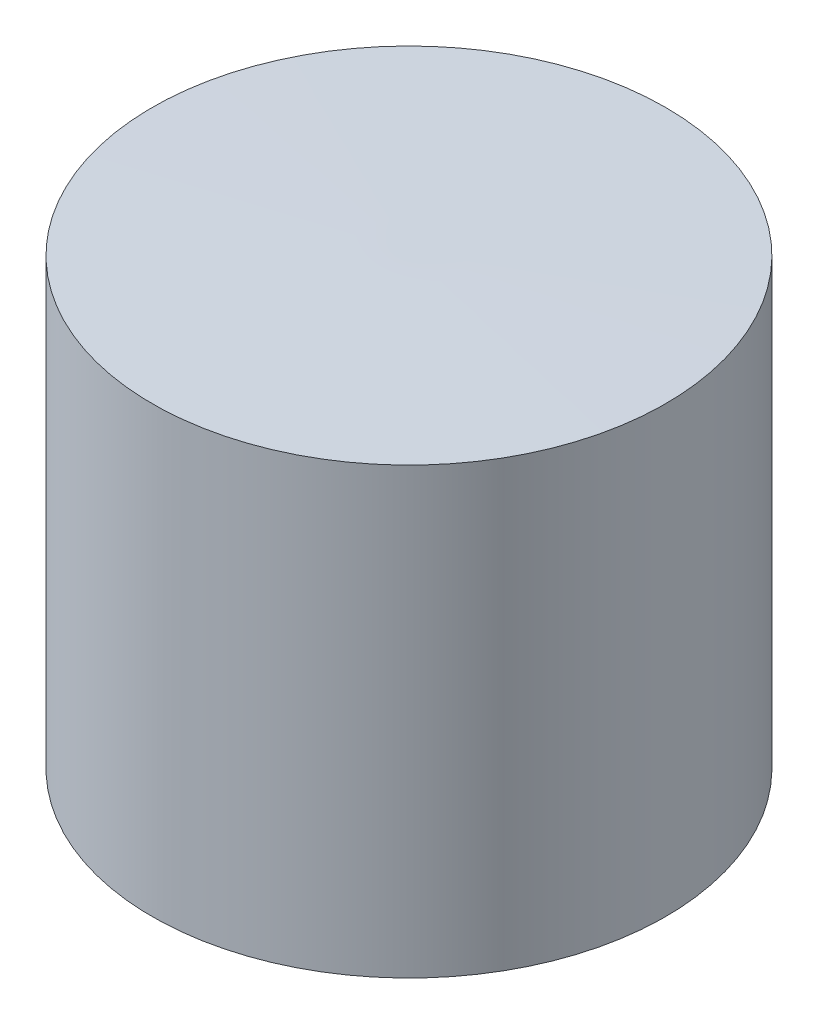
ISO-10303-21;
HEADER;
FILE_DESCRIPTION(('STEP AP214'),'2;1');
FILE_NAME('part.step','',(''),(''),'','','');
FILE_SCHEMA(('AUTOMOTIVE_DESIGN { 1 0 10303 214 1 1 1 1 }'));
ENDSEC;
DATA;
#1=APPLICATION_CONTEXT('core data for automotive mechanical design processes');
#2=APPLICATION_PROTOCOL_DEFINITION('international standard','automotive_design',2000,#1);
#3=PRODUCT_CONTEXT('',#1,'mechanical');
#4=PRODUCT('Part','Part','',(#3));
#5=PRODUCT_RELATED_PRODUCT_CATEGORY('part','',(#4));
#6=PRODUCT_DEFINITION_FORMATION('','',#4);
#7=PRODUCT_DEFINITION_CONTEXT('part definition',#1,'design');
#8=PRODUCT_DEFINITION('design','',#6,#7);
#9=PRODUCT_DEFINITION_SHAPE('','',#8);
#10=(LENGTH_UNIT() NAMED_UNIT(*) SI_UNIT(.MILLI.,.METRE.));
#11=(NAMED_UNIT(*) PLANE_ANGLE_UNIT() SI_UNIT($,.RADIAN.));
#12=(NAMED_UNIT(*) SI_UNIT($,.STERADIAN.) SOLID_ANGLE_UNIT());
#13=UNCERTAINTY_MEASURE_WITH_UNIT(LENGTH_MEASURE(1.E-05),#10,'distance_accuracy_value','');
#14=(GEOMETRIC_REPRESENTATION_CONTEXT(3) GLOBAL_UNCERTAINTY_ASSIGNED_CONTEXT((#13)) GLOBAL_UNIT_ASSIGNED_CONTEXT((#10,
#11,#12)) REPRESENTATION_CONTEXT('',''));
#15=CARTESIAN_POINT('',(0.,0.,0.));
#16=DIRECTION('',(0.,0.,1.));
#17=DIRECTION('',(1.,0.,0.));
#18=AXIS2_PLACEMENT_3D('',#15,#16,#17);
#19=CARTESIAN_POINT('',(52.07,0.,0.));
#20=DIRECTION('',(0.,-1.,0.));
#21=DIRECTION('',(0.,0.,-1.));
#22=AXIS2_PLACEMENT_3D('',#19,#20,#21);
#23=PLANE('',#22);
#24=CARTESIAN_POINT('',(0.,0.,0.));
#25=DIRECTION('',(0.,-1.,0.));
#26=DIRECTION('',(0.,0.,-1.));
#27=AXIS2_PLACEMENT_3D('',#24,#25,#26);
#28=CIRCLE('',#27,52.07);
#29=CARTESIAN_POINT('',(0.,0.,-52.07));
#30=VERTEX_POINT('',#29);
#31=EDGE_CURVE('E40',#30,#30,#28,.T.);
#32=ORIENTED_EDGE('',*,*,#31,.T.);
#33=EDGE_LOOP('',(#32));
#34=FACE_BOUND('',#33,.T.);
#35=ADVANCED_FACE('F34',(#34),#23,.T.);
#36=CARTESIAN_POINT('',(0.,90.1238830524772,0.));
#37=DIRECTION('',(0.,-1.,0.));
#38=DIRECTION('',(0.,0.,-1.));
#39=AXIS2_PLACEMENT_3D('',#36,#37,#38);
#40=CONICAL_SURFACE('',#39,52.07,1.55625314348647);
#41=CARTESIAN_POINT('',(0.,90.8812,0.));
#42=VERTEX_POINT('',#41);
#43=VERTEX_LOOP('',#42);
#44=FACE_BOUND('',#43,.T.);
#45=CARTESIAN_POINT('',(0.,90.1238830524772,0.));
#46=DIRECTION('',(0.,-1.,0.));
#47=DIRECTION('',(0.,0.,-1.));
#48=AXIS2_PLACEMENT_3D('',#45,#46,#47);
#49=CIRCLE('',#48,52.07);
#50=CARTESIAN_POINT('',(0.,90.1238830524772,-52.07));
#51=VERTEX_POINT('',#50);
#52=EDGE_CURVE('E11',#51,#51,#49,.T.);
#53=ORIENTED_EDGE('',*,*,#52,.F.);
#54=EDGE_LOOP('',(#53));
#55=FACE_BOUND('',#54,.T.);
#56=ADVANCED_FACE('F43',(#44,#55),#40,.T.);
#57=CARTESIAN_POINT('',(0.,0.,0.));
#58=DIRECTION('',(0.,-1.,0.));
#59=DIRECTION('',(0.,0.,-1.));
#60=AXIS2_PLACEMENT_3D('',#57,#58,#59);
#61=CYLINDRICAL_SURFACE('',#60,52.07);
#62=ORIENTED_EDGE('',*,*,#52,.T.);
#63=EDGE_LOOP('',(#62));
#64=FACE_BOUND('',#63,.T.);
#65=ORIENTED_EDGE('',*,*,#31,.F.);
#66=EDGE_LOOP('',(#65));
#67=FACE_BOUND('',#66,.T.);
#68=ADVANCED_FACE('F46',(#64,#67),#61,.T.);
#69=CLOSED_SHELL('',(#35,#56,#68));
#70=MANIFOLD_SOLID_BREP('B2',#69);
#71=ADVANCED_BREP_SHAPE_REPRESENTATION('',(#18,#70),#14);
#72=SHAPE_DEFINITION_REPRESENTATION(#9,#71);
ENDSEC;
END-ISO-10303-21;
